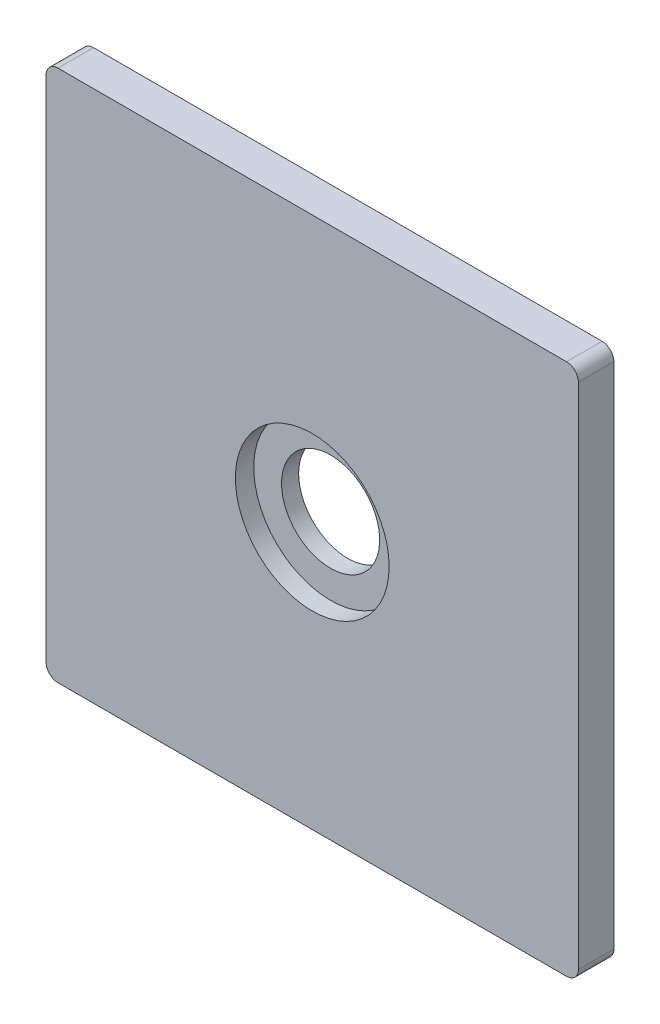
ISO-10303-21;
HEADER;
FILE_DESCRIPTION(('STEP AP214'),'2;1');
FILE_NAME('part.step','',(''),(''),'','','');
FILE_SCHEMA(('AUTOMOTIVE_DESIGN { 1 0 10303 214 1 1 1 1 }'));
ENDSEC;
DATA;
#1=APPLICATION_CONTEXT('core data for automotive mechanical design processes');
#2=APPLICATION_PROTOCOL_DEFINITION('international standard','automotive_design',2000,#1);
#3=PRODUCT_CONTEXT('',#1,'mechanical');
#4=PRODUCT('Part','Part','',(#3));
#5=PRODUCT_RELATED_PRODUCT_CATEGORY('part','',(#4));
#6=PRODUCT_DEFINITION_FORMATION('','',#4);
#7=PRODUCT_DEFINITION_CONTEXT('part definition',#1,'design');
#8=PRODUCT_DEFINITION('design','',#6,#7);
#9=PRODUCT_DEFINITION_SHAPE('','',#8);
#10=(LENGTH_UNIT() NAMED_UNIT(*) SI_UNIT(.MILLI.,.METRE.));
#11=(NAMED_UNIT(*) PLANE_ANGLE_UNIT() SI_UNIT($,.RADIAN.));
#12=(NAMED_UNIT(*) SI_UNIT($,.STERADIAN.) SOLID_ANGLE_UNIT());
#13=UNCERTAINTY_MEASURE_WITH_UNIT(LENGTH_MEASURE(1.E-05),#10,'distance_accuracy_value','');
#14=(GEOMETRIC_REPRESENTATION_CONTEXT(3) GLOBAL_UNCERTAINTY_ASSIGNED_CONTEXT((#13)) GLOBAL_UNIT_ASSIGNED_CONTEXT((#10,
#11,#12)) REPRESENTATION_CONTEXT('',''));
#15=CARTESIAN_POINT('',(0.,0.,0.));
#16=DIRECTION('',(0.,0.,1.));
#17=DIRECTION('',(1.,0.,0.));
#18=AXIS2_PLACEMENT_3D('',#15,#16,#17);
#19=CARTESIAN_POINT('',(0.,0.,3.));
#20=DIRECTION('',(0.,0.,-1.));
#21=DIRECTION('',(-1.,0.,0.));
#22=AXIS2_PLACEMENT_3D('',#19,#20,#21);
#23=CYLINDRICAL_SURFACE('',#22,6.5);
#24=CARTESIAN_POINT('',(0.,0.,1.45));
#25=DIRECTION('',(0.,0.,-1.));
#26=DIRECTION('',(-1.,0.,0.));
#27=AXIS2_PLACEMENT_3D('',#24,#25,#26);
#28=CIRCLE('',#27,6.5);
#29=CARTESIAN_POINT('',(6.50000000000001,0.,1.45));
#30=VERTEX_POINT('',#29);
#31=EDGE_CURVE('E151',#30,#30,#28,.T.);
#32=ORIENTED_EDGE('',*,*,#31,.T.);
#33=EDGE_LOOP('',(#32));
#34=FACE_BOUND('',#33,.T.);
#35=CARTESIAN_POINT('',(0.,0.,3.));
#36=DIRECTION('',(0.,0.,-1.));
#37=DIRECTION('',(-1.,0.,0.));
#38=AXIS2_PLACEMENT_3D('',#35,#36,#37);
#39=CIRCLE('',#38,6.5);
#40=CARTESIAN_POINT('',(6.50000000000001,0.,3.));
#41=VERTEX_POINT('',#40);
#42=EDGE_CURVE('E41',#41,#41,#39,.T.);
#43=ORIENTED_EDGE('',*,*,#42,.F.);
#44=EDGE_LOOP('',(#43));
#45=FACE_BOUND('',#44,.T.);
#46=ADVANCED_FACE('F19',(#34,#45),#23,.F.);
#47=CARTESIAN_POINT('',(-21.5,21.5,0.));
#48=DIRECTION('',(0.,0.,1.));
#49=DIRECTION('',(1.,0.,0.));
#50=AXIS2_PLACEMENT_3D('',#47,#48,#49);
#51=CYLINDRICAL_SURFACE('',#50,1.);
#52=CARTESIAN_POINT('',(-21.5,21.5,0.));
#53=DIRECTION('',(0.,0.,1.));
#54=DIRECTION('',(1.,0.,0.));
#55=AXIS2_PLACEMENT_3D('',#52,#53,#54);
#56=CIRCLE('',#55,1.);
#57=CARTESIAN_POINT('',(-21.5,22.5,0.));
#58=VERTEX_POINT('',#57);
#59=CARTESIAN_POINT('',(-22.5,21.5,0.));
#60=VERTEX_POINT('',#59);
#61=EDGE_CURVE('E23',#58,#60,#56,.T.);
#62=ORIENTED_EDGE('',*,*,#61,.T.);
#63=DIRECTION('',(0.,0.,1.));
#64=VECTOR('',#63,1.);
#65=CARTESIAN_POINT('',(-22.5,21.5,0.));
#66=LINE('',#65,#64);
#67=CARTESIAN_POINT('',(-22.5,21.5,3.));
#68=VERTEX_POINT('',#67);
#69=EDGE_CURVE('E97',#68,#60,#66,.F.);
#70=ORIENTED_EDGE('',*,*,#69,.F.);
#71=CARTESIAN_POINT('',(-21.5,21.5,3.));
#72=DIRECTION('',(0.,0.,1.));
#73=DIRECTION('',(1.,0.,0.));
#74=AXIS2_PLACEMENT_3D('',#71,#72,#73);
#75=CIRCLE('',#74,1.);
#76=CARTESIAN_POINT('',(-21.5,22.5,3.));
#77=VERTEX_POINT('',#76);
#78=EDGE_CURVE('E180',#77,#68,#75,.T.);
#79=ORIENTED_EDGE('',*,*,#78,.F.);
#80=DIRECTION('',(0.,0.,1.));
#81=VECTOR('',#80,1.);
#82=CARTESIAN_POINT('',(-21.5,22.5,0.));
#83=LINE('',#82,#81);
#84=EDGE_CURVE('E98',#58,#77,#83,.T.);
#85=ORIENTED_EDGE('',*,*,#84,.F.);
#86=EDGE_LOOP('',(#62,#70,#79,#85));
#87=FACE_BOUND('',#86,.T.);
#88=ADVANCED_FACE('F95',(#87),#51,.T.);
#89=CARTESIAN_POINT('',(-21.5,-21.5,0.));
#90=DIRECTION('',(0.,0.,1.));
#91=DIRECTION('',(1.,0.,0.));
#92=AXIS2_PLACEMENT_3D('',#89,#90,#91);
#93=CYLINDRICAL_SURFACE('',#92,1.);
#94=CARTESIAN_POINT('',(-21.5,-21.5,0.));
#95=DIRECTION('',(0.,0.,1.));
#96=DIRECTION('',(1.,0.,0.));
#97=AXIS2_PLACEMENT_3D('',#94,#95,#96);
#98=CIRCLE('',#97,1.);
#99=CARTESIAN_POINT('',(-22.5,-21.5,0.));
#100=VERTEX_POINT('',#99);
#101=CARTESIAN_POINT('',(-21.5,-22.5,0.));
#102=VERTEX_POINT('',#101);
#103=EDGE_CURVE('E100',#100,#102,#98,.T.);
#104=ORIENTED_EDGE('',*,*,#103,.T.);
#105=DIRECTION('',(0.,0.,-1.));
#106=VECTOR('',#105,1.);
#107=CARTESIAN_POINT('',(-21.5,-22.5,0.));
#108=LINE('',#107,#106);
#109=CARTESIAN_POINT('',(-21.5,-22.5,3.));
#110=VERTEX_POINT('',#109);
#111=EDGE_CURVE('E137',#110,#102,#108,.T.);
#112=ORIENTED_EDGE('',*,*,#111,.F.);
#113=CARTESIAN_POINT('',(-21.5,-21.5,3.));
#114=DIRECTION('',(0.,0.,1.));
#115=DIRECTION('',(1.,0.,0.));
#116=AXIS2_PLACEMENT_3D('',#113,#114,#115);
#117=CIRCLE('',#116,1.);
#118=CARTESIAN_POINT('',(-22.5,-21.5,3.));
#119=VERTEX_POINT('',#118);
#120=EDGE_CURVE('E177',#119,#110,#117,.T.);
#121=ORIENTED_EDGE('',*,*,#120,.F.);
#122=DIRECTION('',(0.,0.,1.));
#123=VECTOR('',#122,1.);
#124=CARTESIAN_POINT('',(-22.5,-21.5,0.));
#125=LINE('',#124,#123);
#126=EDGE_CURVE('E108',#100,#119,#125,.T.);
#127=ORIENTED_EDGE('',*,*,#126,.F.);
#128=EDGE_LOOP('',(#104,#112,#121,#127));
#129=FACE_BOUND('',#128,.T.);
#130=ADVANCED_FACE('F188',(#129),#93,.T.);
#131=CARTESIAN_POINT('',(21.5,21.5,0.));
#132=DIRECTION('',(0.,0.,1.));
#133=DIRECTION('',(1.,0.,0.));
#134=AXIS2_PLACEMENT_3D('',#131,#132,#133);
#135=CYLINDRICAL_SURFACE('',#134,1.);
#136=CARTESIAN_POINT('',(21.5,21.5,0.));
#137=DIRECTION('',(0.,0.,1.));
#138=DIRECTION('',(1.,0.,0.));
#139=AXIS2_PLACEMENT_3D('',#136,#137,#138);
#140=CIRCLE('',#139,1.);
#141=CARTESIAN_POINT('',(22.5,21.5,0.));
#142=VERTEX_POINT('',#141);
#143=CARTESIAN_POINT('',(21.5,22.5,0.));
#144=VERTEX_POINT('',#143);
#145=EDGE_CURVE('E184',#142,#144,#140,.T.);
#146=ORIENTED_EDGE('',*,*,#145,.T.);
#147=DIRECTION('',(0.,0.,1.));
#148=VECTOR('',#147,1.);
#149=CARTESIAN_POINT('',(21.5,22.5,0.));
#150=LINE('',#149,#148);
#151=CARTESIAN_POINT('',(21.5,22.5,3.));
#152=VERTEX_POINT('',#151);
#153=EDGE_CURVE('E148',#152,#144,#150,.F.);
#154=ORIENTED_EDGE('',*,*,#153,.F.);
#155=CARTESIAN_POINT('',(21.5,21.5,3.));
#156=DIRECTION('',(0.,0.,1.));
#157=DIRECTION('',(1.,0.,0.));
#158=AXIS2_PLACEMENT_3D('',#155,#156,#157);
#159=CIRCLE('',#158,1.);
#160=CARTESIAN_POINT('',(22.5,21.5,3.));
#161=VERTEX_POINT('',#160);
#162=EDGE_CURVE('E182',#161,#152,#159,.T.);
#163=ORIENTED_EDGE('',*,*,#162,.F.);
#164=DIRECTION('',(0.,0.,-1.));
#165=VECTOR('',#164,1.);
#166=CARTESIAN_POINT('',(22.5,21.5,0.));
#167=LINE('',#166,#165);
#168=EDGE_CURVE('E135',#142,#161,#167,.F.);
#169=ORIENTED_EDGE('',*,*,#168,.F.);
#170=EDGE_LOOP('',(#146,#154,#163,#169));
#171=FACE_BOUND('',#170,.T.);
#172=ADVANCED_FACE('F212',(#171),#135,.T.);
#173=CARTESIAN_POINT('',(0.,0.,3.));
#174=DIRECTION('',(0.,0.,1.));
#175=DIRECTION('',(1.,0.,0.));
#176=AXIS2_PLACEMENT_3D('',#173,#174,#175);
#177=PLANE('',#176);
#178=ORIENTED_EDGE('',*,*,#42,.T.);
#179=EDGE_LOOP('',(#178));
#180=FACE_BOUND('',#179,.T.);
#181=CARTESIAN_POINT('',(21.5,-21.5,3.));
#182=DIRECTION('',(0.,0.,1.));
#183=DIRECTION('',(1.,0.,0.));
#184=AXIS2_PLACEMENT_3D('',#181,#182,#183);
#185=CIRCLE('',#184,1.);
#186=CARTESIAN_POINT('',(22.5,-21.5,3.));
#187=VERTEX_POINT('',#186);
#188=CARTESIAN_POINT('',(21.5,-22.5,3.));
#189=VERTEX_POINT('',#188);
#190=EDGE_CURVE('E172',#187,#189,#185,.F.);
#191=ORIENTED_EDGE('',*,*,#190,.F.);
#192=DIRECTION('',(0.,1.,0.));
#193=VECTOR('',#192,1.);
#194=CARTESIAN_POINT('',(22.5,22.5,3.));
#195=LINE('',#194,#193);
#196=EDGE_CURVE('E134',#161,#187,#195,.F.);
#197=ORIENTED_EDGE('',*,*,#196,.F.);
#198=ORIENTED_EDGE('',*,*,#162,.T.);
#199=DIRECTION('',(1.,0.,0.));
#200=VECTOR('',#199,1.);
#201=CARTESIAN_POINT('',(-22.5,22.5,3.));
#202=LINE('',#201,#200);
#203=EDGE_CURVE('E109',#77,#152,#202,.T.);
#204=ORIENTED_EDGE('',*,*,#203,.F.);
#205=ORIENTED_EDGE('',*,*,#78,.T.);
#206=DIRECTION('',(0.,1.,0.));
#207=VECTOR('',#206,1.);
#208=CARTESIAN_POINT('',(-22.5,-22.5,3.));
#209=LINE('',#208,#207);
#210=EDGE_CURVE('E107',#119,#68,#209,.T.);
#211=ORIENTED_EDGE('',*,*,#210,.F.);
#212=ORIENTED_EDGE('',*,*,#120,.T.);
#213=DIRECTION('',(1.,0.,0.));
#214=VECTOR('',#213,1.);
#215=CARTESIAN_POINT('',(22.5,-22.5,3.));
#216=LINE('',#215,#214);
#217=EDGE_CURVE('E141',#189,#110,#216,.F.);
#218=ORIENTED_EDGE('',*,*,#217,.F.);
#219=EDGE_LOOP('',(#191,#197,#198,#204,#205,#211,#212,#218));
#220=FACE_BOUND('',#219,.T.);
#221=ADVANCED_FACE('F204',(#180,#220),#177,.T.);
#222=CARTESIAN_POINT('',(21.5,-21.5,0.));
#223=DIRECTION('',(0.,0.,1.));
#224=DIRECTION('',(1.,0.,0.));
#225=AXIS2_PLACEMENT_3D('',#222,#223,#224);
#226=CYLINDRICAL_SURFACE('',#225,1.);
#227=CARTESIAN_POINT('',(21.5,-21.5,0.));
#228=DIRECTION('',(0.,0.,1.));
#229=DIRECTION('',(1.,0.,0.));
#230=AXIS2_PLACEMENT_3D('',#227,#228,#229);
#231=CIRCLE('',#230,1.);
#232=CARTESIAN_POINT('',(21.5,-22.5,0.));
#233=VERTEX_POINT('',#232);
#234=CARTESIAN_POINT('',(22.5,-21.5,0.));
#235=VERTEX_POINT('',#234);
#236=EDGE_CURVE('E168',#233,#235,#231,.T.);
#237=ORIENTED_EDGE('',*,*,#236,.T.);
#238=DIRECTION('',(0.,0.,-1.));
#239=VECTOR('',#238,1.);
#240=CARTESIAN_POINT('',(22.5,-21.5,0.));
#241=LINE('',#240,#239);
#242=EDGE_CURVE('E130',#187,#235,#241,.T.);
#243=ORIENTED_EDGE('',*,*,#242,.F.);
#244=ORIENTED_EDGE('',*,*,#190,.T.);
#245=DIRECTION('',(0.,0.,-1.));
#246=VECTOR('',#245,1.);
#247=CARTESIAN_POINT('',(21.5,-22.5,0.));
#248=LINE('',#247,#246);
#249=EDGE_CURVE('E142',#233,#189,#248,.F.);
#250=ORIENTED_EDGE('',*,*,#249,.F.);
#251=EDGE_LOOP('',(#237,#243,#244,#250));
#252=FACE_BOUND('',#251,.T.);
#253=ADVANCED_FACE('F200',(#252),#226,.T.);
#254=CARTESIAN_POINT('',(-6.63,6.63,1.45));
#255=DIRECTION('',(0.,0.,-1.));
#256=DIRECTION('',(1.,0.,0.));
#257=AXIS2_PLACEMENT_3D('',#254,#255,#256);
#258=PLANE('',#257);
#259=CARTESIAN_POINT('',(0.,0.,1.45));
#260=DIRECTION('',(0.,0.,-1.));
#261=DIRECTION('',(0.,1.,0.));
#262=AXIS2_PLACEMENT_3D('',#259,#260,#261);
#263=CIRCLE('',#262,4.15);
#264=CARTESIAN_POINT('',(-4.15,0.,1.45));
#265=VERTEX_POINT('',#264);
#266=EDGE_CURVE('E126',#265,#265,#263,.T.);
#267=ORIENTED_EDGE('',*,*,#266,.T.);
#268=EDGE_LOOP('',(#267));
#269=FACE_BOUND('',#268,.T.);
#270=ORIENTED_EDGE('',*,*,#31,.F.);
#271=EDGE_LOOP('',(#270));
#272=FACE_BOUND('',#271,.T.);
#273=ADVANCED_FACE('F240',(#269,#272),#258,.F.);
#274=CARTESIAN_POINT('',(-22.5,22.5,0.));
#275=DIRECTION('',(0.,1.,0.));
#276=DIRECTION('',(0.,0.,1.));
#277=AXIS2_PLACEMENT_3D('',#274,#275,#276);
#278=PLANE('',#277);
#279=ORIENTED_EDGE('',*,*,#84,.T.);
#280=ORIENTED_EDGE('',*,*,#203,.T.);
#281=ORIENTED_EDGE('',*,*,#153,.T.);
#282=DIRECTION('',(1.,0.,0.));
#283=VECTOR('',#282,1.);
#284=CARTESIAN_POINT('',(0.,22.5,0.));
#285=LINE('',#284,#283);
#286=EDGE_CURVE('E117',#144,#58,#285,.F.);
#287=ORIENTED_EDGE('',*,*,#286,.T.);
#288=EDGE_LOOP('',(#279,#280,#281,#287));
#289=FACE_BOUND('',#288,.T.);
#290=ADVANCED_FACE('F210',(#289),#278,.T.);
#291=CARTESIAN_POINT('',(-22.5,-22.5,0.));
#292=DIRECTION('',(-1.,0.,0.));
#293=DIRECTION('',(0.,0.,1.));
#294=AXIS2_PLACEMENT_3D('',#291,#292,#293);
#295=PLANE('',#294);
#296=ORIENTED_EDGE('',*,*,#126,.T.);
#297=ORIENTED_EDGE('',*,*,#210,.T.);
#298=ORIENTED_EDGE('',*,*,#69,.T.);
#299=DIRECTION('',(0.,1.,0.));
#300=VECTOR('',#299,1.);
#301=CARTESIAN_POINT('',(-22.5,0.,0.));
#302=LINE('',#301,#300);
#303=EDGE_CURVE('E105',#60,#100,#302,.F.);
#304=ORIENTED_EDGE('',*,*,#303,.T.);
#305=EDGE_LOOP('',(#296,#297,#298,#304));
#306=FACE_BOUND('',#305,.T.);
#307=ADVANCED_FACE('F104',(#306),#295,.T.);
#308=CARTESIAN_POINT('',(22.5,-22.5,0.));
#309=DIRECTION('',(0.,-1.,0.));
#310=DIRECTION('',(0.,0.,-1.));
#311=AXIS2_PLACEMENT_3D('',#308,#309,#310);
#312=PLANE('',#311);
#313=ORIENTED_EDGE('',*,*,#111,.T.);
#314=DIRECTION('',(1.,0.,0.));
#315=VECTOR('',#314,1.);
#316=CARTESIAN_POINT('',(0.,-22.5,0.));
#317=LINE('',#316,#315);
#318=EDGE_CURVE('E116',#102,#233,#317,.T.);
#319=ORIENTED_EDGE('',*,*,#318,.T.);
#320=ORIENTED_EDGE('',*,*,#249,.T.);
#321=ORIENTED_EDGE('',*,*,#217,.T.);
#322=EDGE_LOOP('',(#313,#319,#320,#321));
#323=FACE_BOUND('',#322,.T.);
#324=ADVANCED_FACE('F191',(#323),#312,.T.);
#325=CARTESIAN_POINT('',(22.5,22.5,0.));
#326=DIRECTION('',(1.,0.,0.));
#327=DIRECTION('',(0.,0.,-1.));
#328=AXIS2_PLACEMENT_3D('',#325,#326,#327);
#329=PLANE('',#328);
#330=ORIENTED_EDGE('',*,*,#242,.T.);
#331=DIRECTION('',(0.,1.,0.));
#332=VECTOR('',#331,1.);
#333=CARTESIAN_POINT('',(22.5,0.,0.));
#334=LINE('',#333,#332);
#335=EDGE_CURVE('E30',#235,#142,#334,.T.);
#336=ORIENTED_EDGE('',*,*,#335,.T.);
#337=ORIENTED_EDGE('',*,*,#168,.T.);
#338=ORIENTED_EDGE('',*,*,#196,.T.);
#339=EDGE_LOOP('',(#330,#336,#337,#338));
#340=FACE_BOUND('',#339,.T.);
#341=ADVANCED_FACE('F215',(#340),#329,.T.);
#342=CARTESIAN_POINT('',(0.,0.,1.45));
#343=DIRECTION('',(0.,0.,-1.));
#344=DIRECTION('',(0.,1.,0.));
#345=AXIS2_PLACEMENT_3D('',#342,#343,#344);
#346=CYLINDRICAL_SURFACE('',#345,4.15);
#347=ORIENTED_EDGE('',*,*,#266,.F.);
#348=EDGE_LOOP('',(#347));
#349=FACE_BOUND('',#348,.T.);
#350=CARTESIAN_POINT('',(0.,0.,0.));
#351=DIRECTION('',(0.,0.,-1.));
#352=DIRECTION('',(0.,1.,0.));
#353=AXIS2_PLACEMENT_3D('',#350,#351,#352);
#354=CIRCLE('',#353,4.15);
#355=CARTESIAN_POINT('',(-4.15,0.,0.));
#356=VERTEX_POINT('',#355);
#357=EDGE_CURVE('E11',#356,#356,#354,.T.);
#358=ORIENTED_EDGE('',*,*,#357,.T.);
#359=EDGE_LOOP('',(#358));
#360=FACE_BOUND('',#359,.T.);
#361=ADVANCED_FACE('F21',(#349,#360),#346,.F.);
#362=CARTESIAN_POINT('',(0.,0.,0.));
#363=DIRECTION('',(0.,0.,1.));
#364=DIRECTION('',(1.,0.,0.));
#365=AXIS2_PLACEMENT_3D('',#362,#363,#364);
#366=PLANE('',#365);
#367=ORIENTED_EDGE('',*,*,#357,.F.);
#368=EDGE_LOOP('',(#367));
#369=FACE_BOUND('',#368,.T.);
#370=ORIENTED_EDGE('',*,*,#335,.F.);
#371=ORIENTED_EDGE('',*,*,#236,.F.);
#372=ORIENTED_EDGE('',*,*,#318,.F.);
#373=ORIENTED_EDGE('',*,*,#103,.F.);
#374=ORIENTED_EDGE('',*,*,#303,.F.);
#375=ORIENTED_EDGE('',*,*,#61,.F.);
#376=ORIENTED_EDGE('',*,*,#286,.F.);
#377=ORIENTED_EDGE('',*,*,#145,.F.);
#378=EDGE_LOOP('',(#370,#371,#372,#373,#374,#375,#376,#377));
#379=FACE_BOUND('',#378,.T.);
#380=ADVANCED_FACE('F112',(#369,#379),#366,.F.);
#381=CLOSED_SHELL('',(#46,#88,#130,#172,#221,#253,#273,#290,#307,#324,#341,#361,#380));
#382=MANIFOLD_SOLID_BREP('B1',#381);
#383=ADVANCED_BREP_SHAPE_REPRESENTATION('',(#18,#382),#14);
#384=SHAPE_DEFINITION_REPRESENTATION(#9,#383);
ENDSEC;
END-ISO-10303-21;
